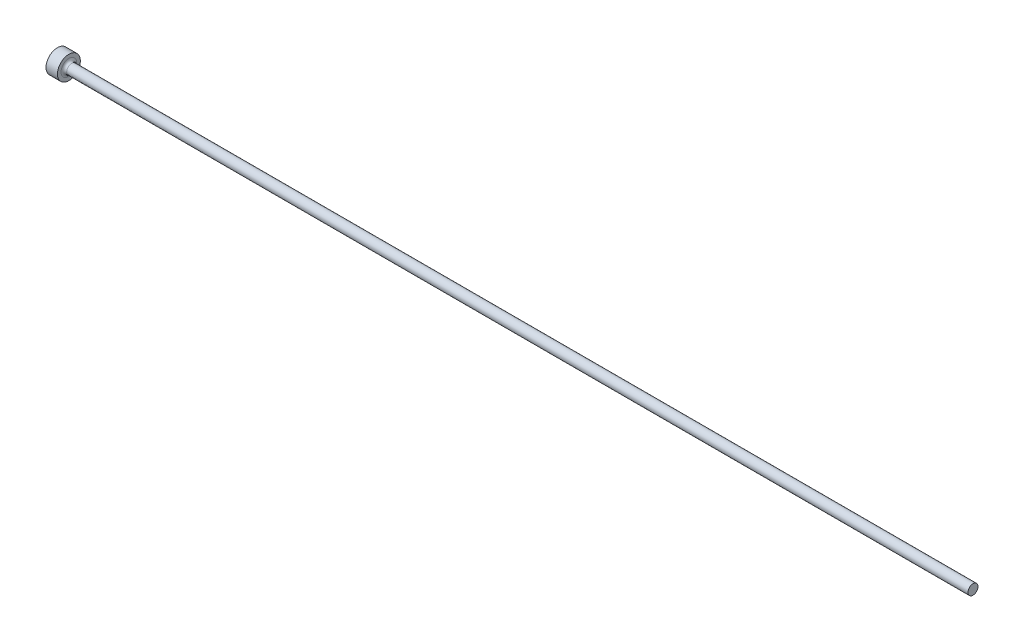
from build123d import *


with BuildPart() as part:
    # Sketch1 → PIN (revolve)
    with BuildSketch(Plane.XY, mode=Mode.PRIVATE) as pin_sk:
        with BuildLine():
            Line((0, 0), (0, 3.175))
            Line((0, 3.175), (3.175, 3.175))
            Line((3.175, 3.175), (3.175, 2.17551))
            ThreePointArc((3.175, 2.17551), (3.40562412, 1.61873412), (3.9624, 1.38811))
            Line((3.9624, 1.38811), (254, 1.38811))
            Line((254, 1.38811), (254, 0))
            Line((254, 0), (0, 0))
        make_face()
    revolve(pin_sk.sketch.rotate(Axis((254, 0, 0), (-1, 0, 0)), 180), axis=Axis((254, 0, 0), (-1, 0, 0)))


solid = part.part
